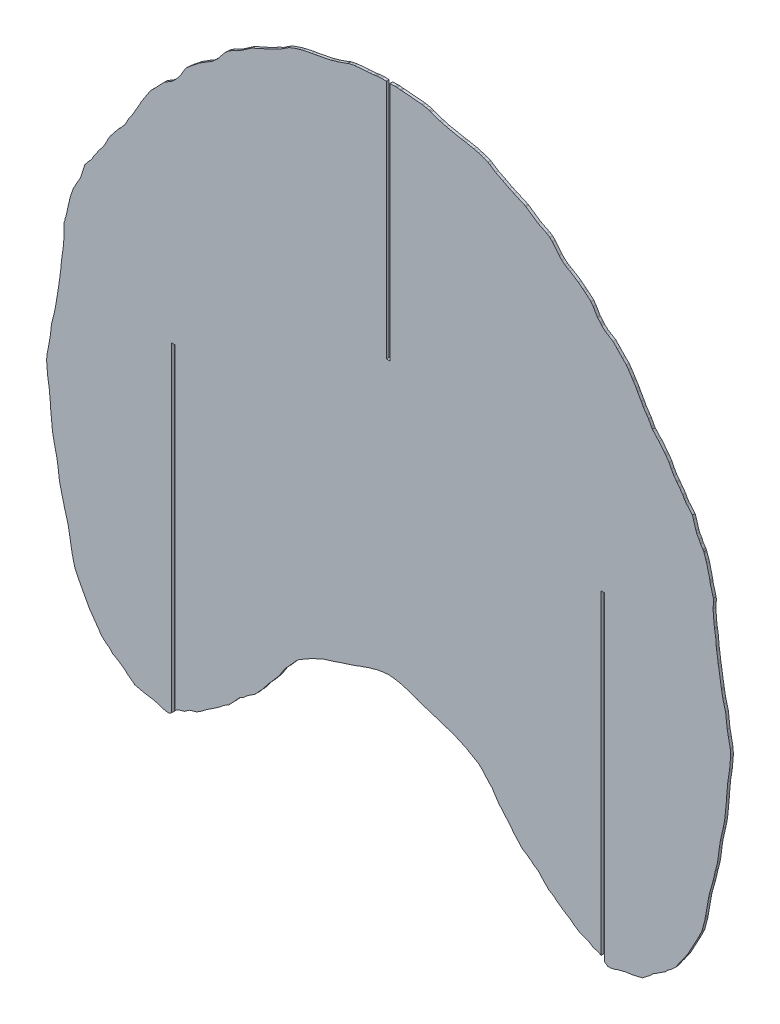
from build123d import *

# Parameters (mm, degrees)
EXTRUDE_1_DEPTH = 2


with BuildPart() as part:
    # Model → Extrude 1 (new body)
    with BuildSketch(Plane.XY):
        Polygon((-4968.8727, 2054.1459), (-4972.0302, 2054.3033), (-4973.663, 2054.203), (-4975.2956, 2054.1029), (-4975.8599, 2054.0262), (-4976.4242, 2053.9498), (-4976.672, 2053.8861), (-4976.9199, 2053.8226), (-4978.1276, 2053.6493), (-4980.5238, 2053.4764), (-4982.9202, 2053.3033), (-4991.4543, 2052.597), (-4992.0593, 2052.4813), (-4994.2126, 2052.0589), (-4996.3659, 2051.6368), (-4996.9471, 2051.3494), (-4997.5284, 2051.0623), (-5004.2963, 2048.6869), (-5005.7665, 2048.3661), (-5007.3816, 2047.8578), (-5008.9967, 2047.3497), (-5020.1828, 2045.1541), (-5022.5702, 2044.7743), (-5028.8949, 2043.4935), (-5030.5226, 2043.0555), (-5032.1504, 2042.6173), (-5033.9631, 2042.0238), (-5035.7756, 2041.4305), (-5038.7476, 2040.2767), (-5038.9575, 2040.1732), (-5039.1675, 2040.0694), (-5040.488, 2039.2628), (-5044.7383, 2036.4613), (-5048.6056, 2034.6222), (-5055.1681, 2031.0882), (-5056.3617, 2030.6375), (-5057.5554, 2030.1871), (-5065.5879, 2026.5345), (-5066.0519, 2026.3006), (-5066.6717, 2025.9105), (-5074.5742, 2020.4788), (-5076.5312, 2019.5111), (-5076.5784, 2019.4286), (-5076.6257, 2019.3463), (-5079.9656, 2017.8443), (-5081.328, 2017.0023), (-5082.6904, 2016.1605), (-5084.7595, 2014.4015), (-5085.3288, 2013.8426), (-5085.8982, 2013.284), (-5090.5989, 2007.3709), (-5091.5746, 2006.5726), (-5094.2019, 2004.025), (-5096.6413, 2002.4683), (-5096.8489, 2002.3673), (-5097.089, 2002.2513), (-5097.329, 2002.1351), (-5097.5746, 2002.035), (-5104.2345, 1997.7999), (-5107.4574, 1995.1798), (-5109.2212, 1993.8536), (-5113.1637, 1990.419), (-5114.8129, 1988.1842), (-5117.3183, 1983.8524), (-5117.5859, 1983.4989), (-5117.7652, 1983.1859), (-5117.9447, 1982.8726), (-5120.415, 1979.971), (-5121.2694, 1978.9647), (-5123.8916, 1976.6449), (-5125.7547, 1975.5257), (-5129.2042, 1973.3988), (-5132.4723, 1970.0335), (-5135.9791, 1966.3057), (-5138.942, 1963.4137), (-5140.5076, 1961.1207), (-5142.9455, 1957.3731), (-5145.9204, 1952.7769), (-5146.8116, 1950.9649), (-5149.9659, 1945.5455), (-5151.5932, 1942.5379), (-5151.853, 1942.1991), (-5152.1127, 1941.8599), (-5152.943, 1940.5611), (-5154.7417, 1938.1046), (-5157.0868, 1933.6693), (-5157.4029, 1933.0824), (-5157.7189, 1932.4952), (-5158.1402, 1932.0579), (-5158.5616, 1931.6209), (-5160.8255, 1929.0128), (-5162.7114, 1927.212), (-5165.4336, 1923.7225), (-5167.7956, 1920.7745), (-5169.6033, 1918.1136), (-5171.8115, 1913.5604), (-5173.3644, 1911.0863), (-5175.1208, 1908.7992), (-5175.2746, 1908.6097), (-5175.4285, 1908.4205), (-5175.6517, 1908.1434), (-5175.875, 1907.8661), (-5176.6948, 1906.6829), (-5179.9867, 1902.1703), (-5180.2864, 1901.5267), (-5180.5861, 1900.8834), (-5182.0613, 1898.472), (-5182.8296, 1897.6698), (-5183.598, 1896.8678), (-5186.4246, 1893.4452), (-5187.6987, 1889.7684), (-5189.3438, 1884.4974), (-5190.1741, 1882.5924), (-5191.0915, 1881.0025), (-5192.267, 1879.0977), (-5194.0179, 1875.6866), (-5194.181, 1875.4449), (-5194.3441, 1875.2032), (-5195.0731, 1873.9786), (-5195.4039, 1872.7362), (-5196.543, 1869.6012), (-5197.0569, 1867.9911), (-5198.8898, 1860.2767), (-5199.5404, 1856.7767), (-5200.4352, 1853.4947), (-5200.908, 1852.0909), (-5200.8514, 1851.8387), (-5200.7948, 1851.5865), (-5201.6117, 1849.5777), (-5201.7248, 1844.9102), (-5201.533, 1841.5428), (-5202.1587, 1833.9964), (-5202.4552, 1831.5438), (-5202.5878, 1830.888), (-5203.4105, 1825.2974), (-5203.9104, 1819.5023), (-5204.0532, 1818.431), (-5204.1957, 1817.6024), (-5204.6232, 1814.0023), (-5205.4156, 1808.2989), (-5206.5376, 1801.3812), (-5207.5008, 1795.5003), (-5207.5439, 1795.2913), (-5207.587, 1795.0821), (-5207.6952, 1794.4544), (-5207.8033, 1793.8265), (-5208.625, 1789.575), (-5209.5233, 1786.1092), (-5210.5983, 1781.9095), (-5211.0936, 1777.6803), (-5211.4256, 1774.3468), (-5213.0848, 1764.9271), (-5213.9125, 1760.9901), (-5214.1803, 1757.7122), (-5214.1161, 1755.7657), (-5213.505, 1748.0684), (-5212.2607, 1739.9603), (-5211.5113, 1732.1139), (-5211.3077, 1729.9154), (-5211.2109, 1727.3573), (-5210.0478, 1715.6363), (-5209.6544, 1712.8114), (-5208.789, 1708.6361), (-5206.7594, 1699.6895), (-5206.0224, 1694.8524), (-5205.0768, 1687.4057), (-5204.6685, 1685.05), (-5203.6745, 1680.8845), (-5202.0981, 1674.6508), (-5201.4184, 1671.8281), (-5201.3592, 1671.582), (-5201.3002, 1671.3356), (-5198.7179, 1662.2018), (-5198.1017, 1658.996), (-5195.826, 1645.7123), (-5195.6883, 1644.9848), (-5193.5817, 1636.8188), (-5190.9919, 1631.5497), (-5183.1245, 1616.843), (-5182.9899, 1616.6684), (-5182.8553, 1616.4936), (-5182.6518, 1616.2597), (-5182.4484, 1616.0256), (-5178.5604, 1610.4086), (-5178.4538, 1610.3037), (-5178.3474, 1610.1987), (-5176.9281, 1608.2314), (-5175.1366, 1605.4704), (-5174.4772, 1604.5788), (-5171.3109, 1601.6957), (-5168.863, 1599.9902), (-5166.4711, 1597.381), (-5162.602, 1595.2116), (-5157.6942, 1591.8088), (-5155.7397, 1589.8405), (-5151.4295, 1586.6701), (-5150.9988, 1586.2778), (-5150.568, 1585.8854), (-5143.4995, 1584.298), (-5143.4755, 1584.289), (-5143.4514, 1584.28), (-5137.2639, 1583.3273), (-5133.1457, 1582.3034), (-5132.2015, 1581.9416), (-5130.6309, 1581.2924), (-5127.2412, 1580.5641), (-5126.4065, 1580.5517), (-5125.5719, 1580.5392), (-5123.8727, 1581.7698), (-5123.8727, 1813.0294), (-5123.6227, 1813.0294), (-5121.6227, 1813.0294), (-5121.3727, 1813.0294), (-5121.3727, 1584.348), (-5121.1834, 1584.6359), (-5118.9874, 1586.0178), (-5115.397, 1587.0524), (-5115.0943, 1587.0866), (-5114.7917, 1587.1208), (-5112.686, 1588.6467), (-5110.8166, 1589.86), (-5108.547, 1590.4841), (-5105.4685, 1591.4592), (-5105.1032, 1591.7524), (-5102.3669, 1593.5261), (-5102.0419, 1593.7155), (-5101.6626, 1593.9968), (-5098.3189, 1596.5908), (-5097.6964, 1596.9902), (-5093.5776, 1599.644), (-5089.3653, 1602.5641), (-5089.0498, 1602.7995), (-5088.7342, 1603.0349), (-5088.503, 1603.2453), (-5086.4233, 1605.0944), (-5083.0885, 1607.0036), (-5082.894, 1607.1479), (-5082.6996, 1607.2922), (-5081.2502, 1608.8813), (-5081.0078, 1609.0805), (-5080.7653, 1609.2795), (-5077.3286, 1612.9387), (-5074.8917, 1615.6755), (-5072.2847, 1617.0637), (-5071.507, 1617.7709), (-5070.7293, 1618.4785), (-5067.859, 1620.7062), (-5064.6759, 1622.7372), (-5063.9843, 1623.165), (-5063.8931, 1623.2812), (-5063.8019, 1623.3972), (-5062.3375, 1624.8068), (-5061.8405, 1625.3657), (-5061.3435, 1625.9247), (-5060.8541, 1626.581), (-5059.1918, 1628.329), (-5057.9394, 1629.7172), (-5053.7328, 1635.1613), (-5050.181, 1639.0624), (-5048.9465, 1640.624), (-5046.6965, 1643.2211), (-5046.0735, 1644.1039), (-5045.8248, 1644.4638), (-5045.5761, 1644.8239), (-5042.0526, 1650.3654), (-5039.5996, 1652.8549), (-5035.806, 1657.1555), (-5035.4493, 1657.5766), (-5035.0926, 1657.9975), (-5034.7793, 1658.3046), (-5032.3949, 1660.6042), (-5031.7991, 1661.0515), (-5028.3648, 1663.0141), (-5027.626, 1663.373), (-5026.8873, 1663.7316), (-5022.8968, 1666.3168), (-5020.8633, 1667.0917), (-5016.7375, 1668.9431), (-5014.5204, 1669.9709), (-5012.2576, 1670.7331), (-5006.7235, 1672.4228), (-5004.0275, 1673.3671), (-5001.0419, 1674.3935), (-4999.816, 1674.7631), (-4993.3539, 1676.8312), (-4991.7895, 1677.3876), (-4990.225, 1677.9438), (-4988.3602, 1678.7006), (-4982.4717, 1680.756), (-4981.0961, 1681.2219), (-4979.1022, 1681.737), (-4977.3762, 1682.2397), (-4975.6503, 1682.7421), (-4972.0091, 1683.4379), (-4971.2378, 1683.5224), (-4969.2404, 1683.7172), (-4967.243, 1683.9123), (-4962.9819, 1683.4909), (-4962.7442, 1683.4636), (-4958.3861, 1682.6037), (-4957.2288, 1682.267), (-4956.0715, 1681.9301), (-4953.4155, 1681.2255), (-4952.8118, 1681.0224), (-4952.2082, 1680.8195), (-4946.452, 1678.8227), (-4944.5178, 1678.0297), (-4942.9518, 1677.4697), (-4941.3857, 1676.9099), (-4935.0289, 1674.8754), (-4934.1433, 1674.6044), (-4933.2578, 1674.3332), (-4930.4501, 1673.364), (-4927.8411, 1672.4499), (-4922.2894, 1670.7546), (-4920.0846, 1670.0207), (-4917.8295, 1668.9743), (-4913.6374, 1667.1061), (-4912.6311, 1666.7206), (-4911.6247, 1666.3349), (-4907.9579, 1663.9555), (-4906.3558, 1663.1762), (-4902.4795, 1660.8893), (-4901.9717, 1660.506), (-4901.4401, 1659.9819), (-4900.9086, 1659.4575), (-4899.8085, 1658.3959), (-4899.5545, 1658.1777), (-4899.3005, 1657.9597), (-4898.7216, 1657.267), (-4898.1427, 1656.5742), (-4894.8082, 1652.7819), (-4892.5626, 1650.518), (-4888.7395, 1644.5732), (-4888.2632, 1643.8832), (-4887.7915, 1643.2187), (-4885.517, 1640.5974), (-4884.9884, 1639.9155), (-4884.4598, 1639.2333), (-4880.9065, 1635.3488), (-4876.6459, 1629.8408), (-4875.9082, 1629.0092), (-4875.1705, 1628.1779), (-4874.3877, 1627.3574), (-4873.605, 1626.5366), (-4873.3925, 1626.2504), (-4873.18, 1625.9645), (-4872.4815, 1625.1782), (-4871.7829, 1624.392), (-4871.1856, 1623.7978), (-4870.5884, 1623.2038), (-4867.0462, 1621.0175), (-4863.9005, 1618.6157), (-4862.0782, 1616.9848), (-4859.4594, 1615.5244), (-4857.1997, 1612.9977), (-4853.9066, 1609.4887), (-4853.6626, 1609.2939), (-4853.4186, 1609.0993), (-4851.745, 1607.2741), (-4851.4789, 1607.08), (-4848.0784, 1605.093), (-4845.9331, 1603.1901), (-4845.7706, 1603.0441), (-4845.5417, 1602.8725), (-4845.3129, 1602.7009), (-4840.9825, 1599.696), (-4836.569, 1596.8412), (-4835.8977, 1596.4091), (-4832.5417, 1593.7834), (-4832.3936, 1593.673), (-4832.1944, 1593.5554), (-4829.1652, 1591.6486), (-4829.0364, 1591.5475), (-4828.9076, 1591.4462), (-4824.8551, 1590.0954), (-4824.0622, 1589.8549), (-4823.2694, 1589.6147), (-4821.3925, 1588.4377), (-4819.3338, 1587.0773), (-4819.0783, 1587.0436), (-4815.5281, 1586.0871), (-4813.8727, 1585.0164), (-4813.8727, 1813.0294), (-4813.6227, 1813.0294), (-4811.6227, 1813.0294), (-4811.3727, 1813.0294), (-4811.3727, 1582.3366), (-4808.9881, 1580.6149), (-4808.079, 1580.6064), (-4807.17, 1580.5978), (-4803.6589, 1581.3325), (-4801.8012, 1582.1266), (-4797.4124, 1583.2358), (-4796.3289, 1583.5266), (-4791.6233, 1584.1271), (-4791.5244, 1584.1252), (-4791.384, 1584.165), (-4783.7893, 1585.9287), (-4782.5276, 1587.0746), (-4778.4067, 1590.1418), (-4776.3628, 1592.361), (-4774.858, 1593.1547), (-4769.1078, 1596.9411), (-4768.3944, 1597.363), (-4767.681, 1597.7849), (-4765.6437, 1599.9318), (-4762.9992, 1601.8095), (-4760.045, 1604.5556), (-4759.3583, 1605.4672), (-4757.7624, 1607.9523), (-4756.1808, 1610.135), (-4756.0369, 1610.2807), (-4755.8929, 1610.4267), (-4751.9327, 1616.1684), (-4751.7775, 1616.3461), (-4751.6223, 1616.5241), (-4751.3947, 1616.821), (-4743.6651, 1631.1818), (-4740.9346, 1636.787), (-4738.7562, 1645.2329), (-4738.5736, 1646.4089), (-4738.4927, 1646.7685), (-4738.4118, 1647.1279), (-4736.2121, 1659.831), (-4735.7923, 1662.0156), (-4733.0704, 1671.6523), (-4732.9847, 1672.0082), (-4732.0597, 1675.8981), (-4731.4685, 1678.665), (-4731.0293, 1680.0522), (-4729.8158, 1685.0424), (-4729.4368, 1687.2199), (-4728.4796, 1694.773), (-4727.7531, 1699.5606), (-4725.7171, 1708.4937), (-4724.7385, 1713.3101), (-4724.4131, 1715.7723), (-4723.2833, 1727.2525), (-4723.2245, 1729.0404), (-4723.0715, 1730.8309), (-4722.3237, 1739.1668), (-4721.0403, 1747.5277), (-4720.3841, 1755.2203), (-4720.3108, 1757.1593), (-4720.5553, 1760.9503), (-4721.8178, 1767.3455), (-4722.7309, 1771.8958), (-4723.3947, 1777.4344), (-4723.8632, 1781.9972), (-4725.0907, 1786.5301), (-4725.8098, 1789.3065), (-4726.7435, 1794.2271), (-4726.8844, 1795.0738), (-4726.929, 1795.2801), (-4726.9737, 1795.4862), (-4728.8599, 1807.5277), (-4729.2599, 1809.6065), (-4729.5174, 1811.6219), (-4730.2805, 1817.1783), (-4730.4728, 1818.2848), (-4730.6829, 1819.9058), (-4731.0396, 1825.1287), (-4731.7879, 1830.0106), (-4731.8681, 1830.4036), (-4731.9482, 1830.7965), (-4732.3087, 1833.7484), (-4732.9734, 1842.1131), (-4732.6384, 1846.3836), (-4732.6753, 1848.9591), (-4733.1838, 1850.4398), (-4734.9946, 1857.1217), (-4735.1671, 1858.1517), (-4735.3003, 1859.1905), (-4737.541, 1868.3878), (-4738.1353, 1870.2623), (-4739.3508, 1873.6265), (-4739.6189, 1874.5479), (-4740.0347, 1875.2296), (-4740.2577, 1875.5999), (-4740.4808, 1875.9701), (-4741.9681, 1878.056), (-4743.1249, 1880.6058), (-4744.5983, 1883.1046), (-4745.2744, 1884.8814), (-4747.1001, 1890.9259), (-4747.8925, 1893.3028), (-4751.2438, 1897.2765), (-4751.7889, 1897.8319), (-4752.334, 1898.3875), (-4753.0079, 1899.391), (-4753.6818, 1900.3946), (-4754.8793, 1902.7498), (-4757.1518, 1905.8548), (-4758.7462, 1908.0252), (-4759.0534, 1908.3895), (-4759.3606, 1908.754), (-4761.2803, 1911.3307), (-4763.0659, 1914.4796), (-4764.7316, 1917.9366), (-4766.951, 1921.1024), (-4767.5013, 1921.7889), (-4768.0516, 1922.4752), (-4771.9487, 1927.4098), (-4772.772, 1928.1888), (-4773.5953, 1928.9681), (-4775.9155, 1931.6517), (-4776.7616, 1932.5116), (-4777.5003, 1933.8724), (-4779.6097, 1937.8289), (-4780.739, 1939.4163), (-4783.2468, 1943.1312), (-4784.7888, 1945.9925), (-4787.5125, 1950.6598), (-4788.4831, 1952.609), (-4790.4585, 1955.6905), (-4790.9613, 1956.4925), (-4791.4641, 1957.2948), (-4794.0087, 1961.1864), (-4795.6412, 1963.5531), (-4798.447, 1966.2743), (-4802.0708, 1970.0855), (-4805.2643, 1973.3773), (-4808.5898, 1975.4132), (-4809.5959, 1976.0247), (-4810.602, 1976.6361), (-4813.3088, 1979.0133), (-4813.9673, 1979.8529), (-4814.6258, 1980.6922), (-4816.1781, 1982.4412), (-4816.2238, 1982.4964), (-4816.2694, 1982.5514), (-4816.3193, 1982.6034), (-4816.3693, 1982.6556), (-4816.4719, 1982.783), (-4819.5277, 1987.9828), (-4821.1998, 1990.3106), (-4825.3565, 1993.9305), (-4826.2054, 1994.5667), (-4827.0543, 1995.2032), (-4830.1744, 1997.7264), (-4836.4026, 2001.7577), (-4837.6654, 2002.3231), (-4837.7605, 2002.3631), (-4837.8555, 2002.4034), (-4838.934, 2003.1493), (-4840.0126, 2003.8953), (-4842.0925, 2005.5072), (-4844.1068, 2007.6297), (-4848.9925, 2013.7328), (-4850.8233, 2015.5199), (-4853.006, 2016.9505), (-4859.4101, 2020.1143), (-4868.0518, 2026.0907), (-4868.3696, 2026.2923), (-4868.5596, 2026.3939), (-4868.7496, 2026.4957), (-4876.5772, 2029.9972), (-4879.8903, 2031.3687), (-4884.7735, 2034.0235), (-4890.014, 2036.5992), (-4894.0471, 2039.2953), (-4895.3162, 2040.0706), (-4895.7127, 2040.2664), (-4898.6185, 2041.3949), (-4900.4885, 2042.0135), (-4902.3585, 2042.6324), (-4903.9816, 2043.0716), (-4905.6046, 2043.5111), (-4911.6309, 2044.7108), (-4913.0628, 2044.9388), (-4914.4947, 2045.1666), (-4925.4549, 2047.3392), (-4928.6656, 2048.3436), (-4930.0995, 2048.6561), (-4936.5582, 2050.9171), (-4937.2486, 2051.2523), (-4937.9391, 2051.5877), (-4940.2086, 2052.0272), (-4942.4781, 2052.4664), (-4943.2266, 2052.5973), (-4957.8572, 2053.8648), (-4958.454, 2053.8741), (-4959.0399, 2053.8614), (-4961.0199, 2054.2266), (-4961.8385, 2054.1825), (-4962.6571, 2054.1385), (-4966.3727, 2054.0785), (-4966.3727, 1880.5521), (-4966.6227, 1880.5521), (-4968.6227, 1880.5521), (-4968.8727, 1880.5521), align=None)
    extrude(amount=EXTRUDE_1_DEPTH)


solid = part.part
